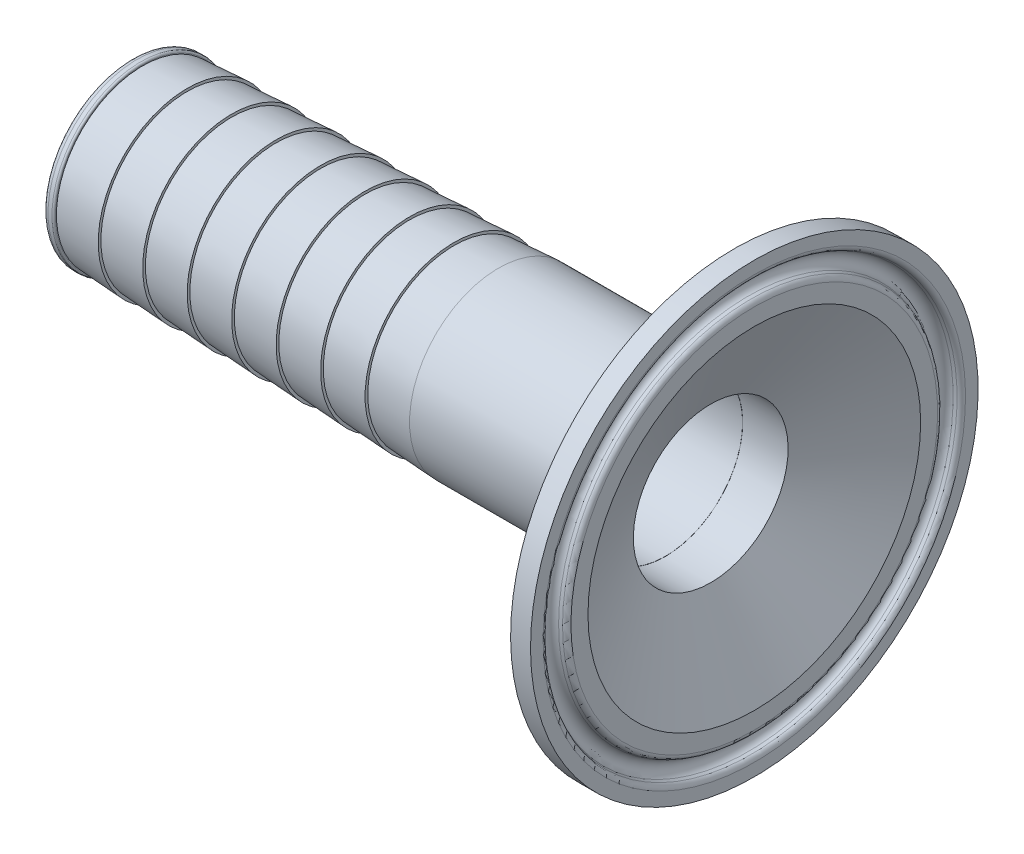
ISO-10303-21;
HEADER;
FILE_DESCRIPTION(('STEP AP214'),'2;1');
FILE_NAME('part.step','',(''),(''),'','','');
FILE_SCHEMA(('AUTOMOTIVE_DESIGN { 1 0 10303 214 1 1 1 1 }'));
ENDSEC;
DATA;
#1=APPLICATION_CONTEXT('core data for automotive mechanical design processes');
#2=APPLICATION_PROTOCOL_DEFINITION('international standard','automotive_design',2000,#1);
#3=PRODUCT_CONTEXT('',#1,'mechanical');
#4=PRODUCT('Part','Part','',(#3));
#5=PRODUCT_RELATED_PRODUCT_CATEGORY('part','',(#4));
#6=PRODUCT_DEFINITION_FORMATION('','',#4);
#7=PRODUCT_DEFINITION_CONTEXT('part definition',#1,'design');
#8=PRODUCT_DEFINITION('design','',#6,#7);
#9=PRODUCT_DEFINITION_SHAPE('','',#8);
#10=(LENGTH_UNIT() NAMED_UNIT(*) SI_UNIT(.MILLI.,.METRE.));
#11=(NAMED_UNIT(*) PLANE_ANGLE_UNIT() SI_UNIT($,.RADIAN.));
#12=(NAMED_UNIT(*) SI_UNIT($,.STERADIAN.) SOLID_ANGLE_UNIT());
#13=UNCERTAINTY_MEASURE_WITH_UNIT(LENGTH_MEASURE(1.E-05),#10,'distance_accuracy_value','');
#14=(GEOMETRIC_REPRESENTATION_CONTEXT(3) GLOBAL_UNCERTAINTY_ASSIGNED_CONTEXT((#13)) GLOBAL_UNIT_ASSIGNED_CONTEXT((#10,
#11,#12)) REPRESENTATION_CONTEXT('',''));
#15=CARTESIAN_POINT('',(0.,0.,0.));
#16=DIRECTION('',(0.,0.,1.));
#17=DIRECTION('',(1.,0.,0.));
#18=AXIS2_PLACEMENT_3D('',#15,#16,#17);
#19=CARTESIAN_POINT('',(59.9390900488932,52.6942676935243,41.7146443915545));
#20=DIRECTION('',(1.,0.,0.));
#21=DIRECTION('',(0.,0.,-1.));
#22=AXIS2_PLACEMENT_3D('',#19,#20,#21);
#23=PLANE('',#22);
#24=CARTESIAN_POINT('',(59.9390900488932,39.9942676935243,41.7146443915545));
#25=DIRECTION('',(1.,0.,0.));
#26=DIRECTION('',(0.,0.,-1.));
#27=AXIS2_PLACEMENT_3D('',#24,#25,#26);
#28=CIRCLE('',#27,11.0297020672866);
#29=CARTESIAN_POINT('',(59.9390900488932,39.9942676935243,30.6849423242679));
#30=VERTEX_POINT('',#29);
#31=EDGE_CURVE('P0_E86',#30,#30,#28,.T.);
#32=ORIENTED_EDGE('',*,*,#31,.F.);
#33=EDGE_LOOP('',(#32));
#34=FACE_BOUND('',#33,.T.);
#35=CARTESIAN_POINT('',(59.9390900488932,39.9942676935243,41.7146443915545));
#36=DIRECTION('',(1.,0.,0.));
#37=DIRECTION('',(0.,0.,-1.));
#38=AXIS2_PLACEMENT_3D('',#35,#36,#37);
#39=CIRCLE('',#38,12.7);
#40=CARTESIAN_POINT('',(59.9390900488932,39.9942676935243,29.0146443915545));
#41=VERTEX_POINT('',#40);
#42=EDGE_CURVE('P0_E10',#41,#41,#39,.T.);
#43=ORIENTED_EDGE('',*,*,#42,.T.);
#44=EDGE_LOOP('',(#43));
#45=FACE_BOUND('',#44,.T.);
#46=ADVANCED_FACE('P0_F15',(#34,#45),#23,.T.);
#47=CARTESIAN_POINT('',(59.9390900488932,39.9942676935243,41.7146443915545));
#48=DIRECTION('',(1.,0.,0.));
#49=DIRECTION('',(0.,0.,-1.));
#50=AXIS2_PLACEMENT_3D('',#47,#48,#49);
#51=CYLINDRICAL_SURFACE('',#50,12.7);
#52=CARTESIAN_POINT('',(36.1138900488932,39.9942676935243,41.7146443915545));
#53=DIRECTION('',(1.,0.,0.));
#54=DIRECTION('',(0.,0.,-1.));
#55=AXIS2_PLACEMENT_3D('',#52,#53,#54);
#56=CIRCLE('',#55,12.7);
#57=CARTESIAN_POINT('',(36.1138900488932,39.9942676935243,29.0146443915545));
#58=VERTEX_POINT('',#57);
#59=EDGE_CURVE('P0_E21',#58,#58,#56,.T.);
#60=ORIENTED_EDGE('',*,*,#59,.T.);
#61=EDGE_LOOP('',(#60));
#62=FACE_BOUND('',#61,.T.);
#63=ORIENTED_EDGE('',*,*,#42,.F.);
#64=EDGE_LOOP('',(#63));
#65=FACE_BOUND('',#64,.T.);
#66=ADVANCED_FACE('P0_F102',(#62,#65),#51,.T.);
#67=CARTESIAN_POINT('',(36.1138900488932,39.9942676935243,41.7146443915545));
#68=DIRECTION('',(1.,0.,0.));
#69=DIRECTION('',(0.,0.,-1.));
#70=AXIS2_PLACEMENT_3D('',#67,#68,#69);
#71=CONICAL_SURFACE('',#70,12.7,0.0599281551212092);
#72=CARTESIAN_POINT('',(29.7638900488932,39.9942676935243,41.7146443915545));
#73=DIRECTION('',(1.,0.,0.));
#74=DIRECTION('',(0.,0.,-1.));
#75=AXIS2_PLACEMENT_3D('',#72,#73,#74);
#76=CIRCLE('',#75,12.319);
#77=CARTESIAN_POINT('',(29.7638900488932,39.9942676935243,29.3956443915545));
#78=VERTEX_POINT('',#77);
#79=EDGE_CURVE('P0_E25',#78,#78,#76,.T.);
#80=ORIENTED_EDGE('',*,*,#79,.T.);
#81=EDGE_LOOP('',(#80));
#82=FACE_BOUND('',#81,.T.);
#83=ORIENTED_EDGE('',*,*,#59,.F.);
#84=EDGE_LOOP('',(#83));
#85=FACE_BOUND('',#84,.T.);
#86=ADVANCED_FACE('P0_F107',(#82,#85),#71,.T.);
#87=CARTESIAN_POINT('',(29.7638900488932,52.6942676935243,41.7146443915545));
#88=DIRECTION('',(1.,0.,0.));
#89=DIRECTION('',(0.,0.,-1.));
#90=AXIS2_PLACEMENT_3D('',#87,#88,#89);
#91=PLANE('',#90);
#92=CARTESIAN_POINT('',(29.7638900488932,39.9942676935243,41.7146443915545));
#93=DIRECTION('',(1.,0.,0.));
#94=DIRECTION('',(0.,0.,-1.));
#95=AXIS2_PLACEMENT_3D('',#92,#93,#94);
#96=CIRCLE('',#95,12.7);
#97=CARTESIAN_POINT('',(29.7638900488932,39.9942676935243,29.0146443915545));
#98=VERTEX_POINT('',#97);
#99=EDGE_CURVE('P0_E29',#98,#98,#96,.T.);
#100=ORIENTED_EDGE('',*,*,#99,.T.);
#101=EDGE_LOOP('',(#100));
#102=FACE_BOUND('',#101,.T.);
#103=ORIENTED_EDGE('',*,*,#79,.F.);
#104=EDGE_LOOP('',(#103));
#105=FACE_BOUND('',#104,.T.);
#106=ADVANCED_FACE('P0_F111',(#102,#105),#91,.T.);
#107=CARTESIAN_POINT('',(29.7638900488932,39.9942676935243,41.7146443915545));
#108=DIRECTION('',(1.,0.,0.));
#109=DIRECTION('',(0.,0.,-1.));
#110=AXIS2_PLACEMENT_3D('',#107,#108,#109);
#111=CONICAL_SURFACE('',#110,12.7,0.0599281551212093);
#112=CARTESIAN_POINT('',(23.4138900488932,39.9942676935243,41.7146443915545));
#113=DIRECTION('',(1.,0.,0.));
#114=DIRECTION('',(0.,0.,-1.));
#115=AXIS2_PLACEMENT_3D('',#112,#113,#114);
#116=CIRCLE('',#115,12.319);
#117=CARTESIAN_POINT('',(23.4138900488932,39.9942676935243,29.3956443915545));
#118=VERTEX_POINT('',#117);
#119=EDGE_CURVE('P0_E34',#118,#118,#116,.T.);
#120=ORIENTED_EDGE('',*,*,#119,.T.);
#121=EDGE_LOOP('',(#120));
#122=FACE_BOUND('',#121,.T.);
#123=ORIENTED_EDGE('',*,*,#99,.F.);
#124=EDGE_LOOP('',(#123));
#125=FACE_BOUND('',#124,.T.);
#126=ADVANCED_FACE('P0_F118',(#122,#125),#111,.T.);
#127=CARTESIAN_POINT('',(23.4138900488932,52.6942676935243,41.7146443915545));
#128=DIRECTION('',(1.,0.,0.));
#129=DIRECTION('',(0.,0.,-1.));
#130=AXIS2_PLACEMENT_3D('',#127,#128,#129);
#131=PLANE('',#130);
#132=CARTESIAN_POINT('',(23.4138900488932,39.9942676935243,41.7146443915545));
#133=DIRECTION('',(1.,0.,0.));
#134=DIRECTION('',(0.,0.,-1.));
#135=AXIS2_PLACEMENT_3D('',#132,#133,#134);
#136=CIRCLE('',#135,12.7);
#137=CARTESIAN_POINT('',(23.4138900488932,39.9942676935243,29.0146443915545));
#138=VERTEX_POINT('',#137);
#139=EDGE_CURVE('P0_E37',#138,#138,#136,.T.);
#140=ORIENTED_EDGE('',*,*,#139,.T.);
#141=EDGE_LOOP('',(#140));
#142=FACE_BOUND('',#141,.T.);
#143=ORIENTED_EDGE('',*,*,#119,.F.);
#144=EDGE_LOOP('',(#143));
#145=FACE_BOUND('',#144,.T.);
#146=ADVANCED_FACE('P0_F122',(#142,#145),#131,.T.);
#147=CARTESIAN_POINT('',(23.4138900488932,39.9942676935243,41.7146443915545));
#148=DIRECTION('',(1.,0.,0.));
#149=DIRECTION('',(0.,0.,-1.));
#150=AXIS2_PLACEMENT_3D('',#147,#148,#149);
#151=CONICAL_SURFACE('',#150,12.7,0.0599281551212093);
#152=CARTESIAN_POINT('',(17.0638900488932,39.9942676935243,41.7146443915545));
#153=DIRECTION('',(1.,0.,0.));
#154=DIRECTION('',(0.,0.,-1.));
#155=AXIS2_PLACEMENT_3D('',#152,#153,#154);
#156=CIRCLE('',#155,12.319);
#157=CARTESIAN_POINT('',(17.0638900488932,39.9942676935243,29.3956443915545));
#158=VERTEX_POINT('',#157);
#159=EDGE_CURVE('P0_E40',#158,#158,#156,.T.);
#160=ORIENTED_EDGE('',*,*,#159,.T.);
#161=EDGE_LOOP('',(#160));
#162=FACE_BOUND('',#161,.T.);
#163=ORIENTED_EDGE('',*,*,#139,.F.);
#164=EDGE_LOOP('',(#163));
#165=FACE_BOUND('',#164,.T.);
#166=ADVANCED_FACE('P0_F126',(#162,#165),#151,.T.);
#167=CARTESIAN_POINT('',(17.0638900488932,52.6942676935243,41.7146443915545));
#168=DIRECTION('',(1.,0.,0.));
#169=DIRECTION('',(0.,0.,-1.));
#170=AXIS2_PLACEMENT_3D('',#167,#168,#169);
#171=PLANE('',#170);
#172=CARTESIAN_POINT('',(17.0638900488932,39.9942676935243,41.7146443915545));
#173=DIRECTION('',(1.,0.,0.));
#174=DIRECTION('',(0.,0.,-1.));
#175=AXIS2_PLACEMENT_3D('',#172,#173,#174);
#176=CIRCLE('',#175,12.7);
#177=CARTESIAN_POINT('',(17.0638900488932,39.9942676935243,29.0146443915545));
#178=VERTEX_POINT('',#177);
#179=EDGE_CURVE('P0_E43',#178,#178,#176,.T.);
#180=ORIENTED_EDGE('',*,*,#179,.T.);
#181=EDGE_LOOP('',(#180));
#182=FACE_BOUND('',#181,.T.);
#183=ORIENTED_EDGE('',*,*,#159,.F.);
#184=EDGE_LOOP('',(#183));
#185=FACE_BOUND('',#184,.T.);
#186=ADVANCED_FACE('P0_F130',(#182,#185),#171,.T.);
#187=CARTESIAN_POINT('',(17.0638900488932,39.9942676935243,41.7146443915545));
#188=DIRECTION('',(1.,0.,0.));
#189=DIRECTION('',(0.,0.,-1.));
#190=AXIS2_PLACEMENT_3D('',#187,#188,#189);
#191=CONICAL_SURFACE('',#190,12.7,0.0599281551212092);
#192=CARTESIAN_POINT('',(10.7138900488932,39.9942676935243,41.7146443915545));
#193=DIRECTION('',(1.,0.,0.));
#194=DIRECTION('',(0.,0.,-1.));
#195=AXIS2_PLACEMENT_3D('',#192,#193,#194);
#196=CIRCLE('',#195,12.319);
#197=CARTESIAN_POINT('',(10.7138900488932,39.9942676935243,29.3956443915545));
#198=VERTEX_POINT('',#197);
#199=EDGE_CURVE('P0_E46',#198,#198,#196,.T.);
#200=ORIENTED_EDGE('',*,*,#199,.T.);
#201=EDGE_LOOP('',(#200));
#202=FACE_BOUND('',#201,.T.);
#203=ORIENTED_EDGE('',*,*,#179,.F.);
#204=EDGE_LOOP('',(#203));
#205=FACE_BOUND('',#204,.T.);
#206=ADVANCED_FACE('P0_F134',(#202,#205),#191,.T.);
#207=CARTESIAN_POINT('',(10.7138900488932,52.6942676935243,41.7146443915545));
#208=DIRECTION('',(1.,0.,0.));
#209=DIRECTION('',(0.,0.,-1.));
#210=AXIS2_PLACEMENT_3D('',#207,#208,#209);
#211=PLANE('',#210);
#212=CARTESIAN_POINT('',(10.7138900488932,39.9942676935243,41.7146443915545));
#213=DIRECTION('',(1.,0.,0.));
#214=DIRECTION('',(0.,0.,-1.));
#215=AXIS2_PLACEMENT_3D('',#212,#213,#214);
#216=CIRCLE('',#215,12.7);
#217=CARTESIAN_POINT('',(10.7138900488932,39.9942676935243,29.0146443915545));
#218=VERTEX_POINT('',#217);
#219=EDGE_CURVE('P0_E49',#218,#218,#216,.T.);
#220=ORIENTED_EDGE('',*,*,#219,.T.);
#221=EDGE_LOOP('',(#220));
#222=FACE_BOUND('',#221,.T.);
#223=ORIENTED_EDGE('',*,*,#199,.F.);
#224=EDGE_LOOP('',(#223));
#225=FACE_BOUND('',#224,.T.);
#226=ADVANCED_FACE('P0_F138',(#222,#225),#211,.T.);
#227=CARTESIAN_POINT('',(10.7138900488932,39.9942676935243,41.7146443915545));
#228=DIRECTION('',(1.,0.,0.));
#229=DIRECTION('',(0.,0.,-1.));
#230=AXIS2_PLACEMENT_3D('',#227,#228,#229);
#231=CONICAL_SURFACE('',#230,12.7,0.0599281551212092);
#232=CARTESIAN_POINT('',(4.36389004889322,39.9942676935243,41.7146443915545));
#233=DIRECTION('',(1.,0.,0.));
#234=DIRECTION('',(0.,0.,-1.));
#235=AXIS2_PLACEMENT_3D('',#232,#233,#234);
#236=CIRCLE('',#235,12.319);
#237=CARTESIAN_POINT('',(4.36389004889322,39.9942676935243,29.3956443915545));
#238=VERTEX_POINT('',#237);
#239=EDGE_CURVE('P0_E52',#238,#238,#236,.T.);
#240=ORIENTED_EDGE('',*,*,#239,.T.);
#241=EDGE_LOOP('',(#240));
#242=FACE_BOUND('',#241,.T.);
#243=ORIENTED_EDGE('',*,*,#219,.F.);
#244=EDGE_LOOP('',(#243));
#245=FACE_BOUND('',#244,.T.);
#246=ADVANCED_FACE('P0_F142',(#242,#245),#231,.T.);
#247=CARTESIAN_POINT('',(4.36389004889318,52.6942676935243,41.7146443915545));
#248=DIRECTION('',(1.,0.,0.));
#249=DIRECTION('',(0.,0.,-1.));
#250=AXIS2_PLACEMENT_3D('',#247,#248,#249);
#251=PLANE('',#250);
#252=CARTESIAN_POINT('',(4.36389004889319,39.9942676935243,41.7146443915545));
#253=DIRECTION('',(1.,0.,0.));
#254=DIRECTION('',(0.,0.,-1.));
#255=AXIS2_PLACEMENT_3D('',#252,#253,#254);
#256=CIRCLE('',#255,12.7);
#257=CARTESIAN_POINT('',(4.36389004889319,39.9942676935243,29.0146443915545));
#258=VERTEX_POINT('',#257);
#259=EDGE_CURVE('P0_E55',#258,#258,#256,.T.);
#260=ORIENTED_EDGE('',*,*,#259,.T.);
#261=EDGE_LOOP('',(#260));
#262=FACE_BOUND('',#261,.T.);
#263=ORIENTED_EDGE('',*,*,#239,.F.);
#264=EDGE_LOOP('',(#263));
#265=FACE_BOUND('',#264,.T.);
#266=ADVANCED_FACE('P0_F146',(#262,#265),#251,.T.);
#267=CARTESIAN_POINT('',(4.36389004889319,39.9942676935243,41.7146443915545));
#268=DIRECTION('',(1.,0.,0.));
#269=DIRECTION('',(0.,0.,-1.));
#270=AXIS2_PLACEMENT_3D('',#267,#268,#269);
#271=CONICAL_SURFACE('',#270,12.7,0.0599281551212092);
#272=CARTESIAN_POINT('',(-1.9861099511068,39.9942676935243,41.7146443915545));
#273=DIRECTION('',(1.,0.,0.));
#274=DIRECTION('',(0.,0.,-1.));
#275=AXIS2_PLACEMENT_3D('',#272,#273,#274);
#276=CIRCLE('',#275,12.319);
#277=CARTESIAN_POINT('',(-1.9861099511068,39.9942676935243,29.3956443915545));
#278=VERTEX_POINT('',#277);
#279=EDGE_CURVE('P0_E58',#278,#278,#276,.T.);
#280=ORIENTED_EDGE('',*,*,#279,.T.);
#281=EDGE_LOOP('',(#280));
#282=FACE_BOUND('',#281,.T.);
#283=ORIENTED_EDGE('',*,*,#259,.F.);
#284=EDGE_LOOP('',(#283));
#285=FACE_BOUND('',#284,.T.);
#286=ADVANCED_FACE('P0_F150',(#282,#285),#271,.T.);
#287=CARTESIAN_POINT('',(-1.98610995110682,52.6942676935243,41.7146443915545));
#288=DIRECTION('',(1.,0.,0.));
#289=DIRECTION('',(0.,0.,-1.));
#290=AXIS2_PLACEMENT_3D('',#287,#288,#289);
#291=PLANE('',#290);
#292=CARTESIAN_POINT('',(-1.9861099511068,39.9942676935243,41.7146443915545));
#293=DIRECTION('',(1.,0.,0.));
#294=DIRECTION('',(0.,0.,-1.));
#295=AXIS2_PLACEMENT_3D('',#292,#293,#294);
#296=CIRCLE('',#295,12.7);
#297=CARTESIAN_POINT('',(-1.9861099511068,39.9942676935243,29.0146443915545));
#298=VERTEX_POINT('',#297);
#299=EDGE_CURVE('P0_E61',#298,#298,#296,.T.);
#300=ORIENTED_EDGE('',*,*,#299,.T.);
#301=EDGE_LOOP('',(#300));
#302=FACE_BOUND('',#301,.T.);
#303=ORIENTED_EDGE('',*,*,#279,.F.);
#304=EDGE_LOOP('',(#303));
#305=FACE_BOUND('',#304,.T.);
#306=ADVANCED_FACE('P0_F154',(#302,#305),#291,.T.);
#307=CARTESIAN_POINT('',(-1.9861099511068,39.9942676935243,41.7146443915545));
#308=DIRECTION('',(1.,0.,0.));
#309=DIRECTION('',(0.,0.,-1.));
#310=AXIS2_PLACEMENT_3D('',#307,#308,#309);
#311=CONICAL_SURFACE('',#310,12.7,0.0599281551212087);
#312=CARTESIAN_POINT('',(-8.33610995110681,39.9942676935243,41.7146443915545));
#313=DIRECTION('',(1.,0.,0.));
#314=DIRECTION('',(0.,0.,-1.));
#315=AXIS2_PLACEMENT_3D('',#312,#313,#314);
#316=CIRCLE('',#315,12.319);
#317=CARTESIAN_POINT('',(-8.3361099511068,39.9942676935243,29.3956443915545));
#318=VERTEX_POINT('',#317);
#319=EDGE_CURVE('P0_E64',#318,#318,#316,.T.);
#320=ORIENTED_EDGE('',*,*,#319,.T.);
#321=EDGE_LOOP('',(#320));
#322=FACE_BOUND('',#321,.T.);
#323=ORIENTED_EDGE('',*,*,#299,.F.);
#324=EDGE_LOOP('',(#323));
#325=FACE_BOUND('',#324,.T.);
#326=ADVANCED_FACE('P0_F158',(#322,#325),#311,.T.);
#327=CARTESIAN_POINT('',(-8.33610995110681,52.6942676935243,41.7146443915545));
#328=DIRECTION('',(1.,0.,0.));
#329=DIRECTION('',(0.,0.,-1.));
#330=AXIS2_PLACEMENT_3D('',#327,#328,#329);
#331=PLANE('',#330);
#332=CARTESIAN_POINT('',(-8.33610995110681,39.9942676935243,41.7146443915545));
#333=DIRECTION('',(1.,0.,0.));
#334=DIRECTION('',(0.,0.,-1.));
#335=AXIS2_PLACEMENT_3D('',#332,#333,#334);
#336=CIRCLE('',#335,12.7);
#337=CARTESIAN_POINT('',(-8.3361099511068,39.9942676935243,29.0146443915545));
#338=VERTEX_POINT('',#337);
#339=EDGE_CURVE('P0_E67',#338,#338,#336,.T.);
#340=ORIENTED_EDGE('',*,*,#339,.T.);
#341=EDGE_LOOP('',(#340));
#342=FACE_BOUND('',#341,.T.);
#343=ORIENTED_EDGE('',*,*,#319,.F.);
#344=EDGE_LOOP('',(#343));
#345=FACE_BOUND('',#344,.T.);
#346=ADVANCED_FACE('P0_F162',(#342,#345),#331,.T.);
#347=CARTESIAN_POINT('',(-8.33610995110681,39.9942676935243,41.7146443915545));
#348=DIRECTION('',(1.,0.,0.));
#349=DIRECTION('',(0.,0.,-1.));
#350=AXIS2_PLACEMENT_3D('',#347,#348,#349);
#351=CONICAL_SURFACE('',#350,12.7,0.0599281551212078);
#352=CARTESIAN_POINT('',(-14.6861099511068,39.9942676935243,41.7146443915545));
#353=DIRECTION('',(1.,0.,0.));
#354=DIRECTION('',(0.,0.,-1.));
#355=AXIS2_PLACEMENT_3D('',#352,#353,#354);
#356=CIRCLE('',#355,12.319);
#357=CARTESIAN_POINT('',(-14.6861099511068,39.9942676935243,29.3956443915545));
#358=VERTEX_POINT('',#357);
#359=EDGE_CURVE('P0_E70',#358,#358,#356,.T.);
#360=ORIENTED_EDGE('',*,*,#359,.T.);
#361=EDGE_LOOP('',(#360));
#362=FACE_BOUND('',#361,.T.);
#363=ORIENTED_EDGE('',*,*,#339,.F.);
#364=EDGE_LOOP('',(#363));
#365=FACE_BOUND('',#364,.T.);
#366=ADVANCED_FACE('P0_F166',(#362,#365),#351,.T.);
#367=CARTESIAN_POINT('',(-14.6861099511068,52.4402676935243,41.7146443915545));
#368=DIRECTION('',(1.,0.,0.));
#369=DIRECTION('',(0.,0.,-1.));
#370=AXIS2_PLACEMENT_3D('',#367,#368,#369);
#371=PLANE('',#370);
#372=CARTESIAN_POINT('',(-14.6861099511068,39.9942676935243,41.7146443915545));
#373=DIRECTION('',(1.,0.,0.));
#374=DIRECTION('',(0.,0.,-1.));
#375=AXIS2_PLACEMENT_3D('',#372,#373,#374);
#376=CIRCLE('',#375,12.446);
#377=CARTESIAN_POINT('',(-14.6861099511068,39.9942676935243,29.2686443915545));
#378=VERTEX_POINT('',#377);
#379=EDGE_CURVE('P0_E73',#378,#378,#376,.T.);
#380=ORIENTED_EDGE('',*,*,#379,.T.);
#381=EDGE_LOOP('',(#380));
#382=FACE_BOUND('',#381,.T.);
#383=ORIENTED_EDGE('',*,*,#359,.F.);
#384=EDGE_LOOP('',(#383));
#385=FACE_BOUND('',#384,.T.);
#386=ADVANCED_FACE('P0_F170',(#382,#385),#371,.T.);
#387=CARTESIAN_POINT('',(-14.9401099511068,39.9942676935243,41.7146443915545));
#388=DIRECTION('',(1.,0.,0.));
#389=DIRECTION('',(0.,0.,-1.));
#390=AXIS2_PLACEMENT_3D('',#387,#388,#389);
#391=TOROIDAL_SURFACE('',#390,12.446,0.254000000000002);
#392=CARTESIAN_POINT('',(-14.9401099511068,39.9942676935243,41.7146443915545));
#393=DIRECTION('',(1.,0.,0.));
#394=DIRECTION('',(0.,0.,-1.));
#395=AXIS2_PLACEMENT_3D('',#392,#393,#394);
#396=CIRCLE('',#395,12.7);
#397=CARTESIAN_POINT('',(-14.9401099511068,39.9942676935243,29.0146443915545));
#398=VERTEX_POINT('',#397);
#399=EDGE_CURVE('P0_E76',#398,#398,#396,.T.);
#400=ORIENTED_EDGE('',*,*,#399,.T.);
#401=EDGE_LOOP('',(#400));
#402=FACE_BOUND('',#401,.T.);
#403=ORIENTED_EDGE('',*,*,#379,.F.);
#404=EDGE_LOOP('',(#403));
#405=FACE_BOUND('',#404,.T.);
#406=ADVANCED_FACE('P0_F174',(#402,#405),#391,.T.);
#407=CARTESIAN_POINT('',(59.9390900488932,39.9942676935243,41.7146443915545));
#408=DIRECTION('',(1.,0.,0.));
#409=DIRECTION('',(0.,0.,-1.));
#410=AXIS2_PLACEMENT_3D('',#407,#408,#409);
#411=CYLINDRICAL_SURFACE('',#410,12.7);
#412=CARTESIAN_POINT('',(-15.4989099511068,39.9942676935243,41.7146443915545));
#413=DIRECTION('',(1.,0.,0.));
#414=DIRECTION('',(0.,0.,-1.));
#415=AXIS2_PLACEMENT_3D('',#412,#413,#414);
#416=CIRCLE('',#415,12.7);
#417=CARTESIAN_POINT('',(-15.4989099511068,39.9942676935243,29.0146443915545));
#418=VERTEX_POINT('',#417);
#419=EDGE_CURVE('P0_E79',#418,#418,#416,.T.);
#420=ORIENTED_EDGE('',*,*,#419,.T.);
#421=EDGE_LOOP('',(#420));
#422=FACE_BOUND('',#421,.T.);
#423=ORIENTED_EDGE('',*,*,#399,.F.);
#424=EDGE_LOOP('',(#423));
#425=FACE_BOUND('',#424,.T.);
#426=ADVANCED_FACE('P0_F178',(#422,#425),#411,.T.);
#427=CARTESIAN_POINT('',(-15.4989099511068,39.9942676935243,41.7146443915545));
#428=DIRECTION('',(1.,0.,0.));
#429=DIRECTION('',(0.,0.,-1.));
#430=AXIS2_PLACEMENT_3D('',#427,#428,#429);
#431=TOROIDAL_SURFACE('',#430,11.938,0.762);
#432=CARTESIAN_POINT('',(-16.2609099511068,39.9942676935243,41.7146443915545));
#433=DIRECTION('',(1.,0.,0.));
#434=DIRECTION('',(0.,0.,-1.));
#435=AXIS2_PLACEMENT_3D('',#432,#433,#434);
#436=CIRCLE('',#435,11.938);
#437=CARTESIAN_POINT('',(-16.2609099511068,39.9942676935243,29.7766443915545));
#438=VERTEX_POINT('',#437);
#439=EDGE_CURVE('P0_E82',#438,#438,#436,.T.);
#440=ORIENTED_EDGE('',*,*,#439,.T.);
#441=EDGE_LOOP('',(#440));
#442=FACE_BOUND('',#441,.T.);
#443=ORIENTED_EDGE('',*,*,#419,.F.);
#444=EDGE_LOOP('',(#443));
#445=FACE_BOUND('',#444,.T.);
#446=ADVANCED_FACE('P0_F182',(#442,#445),#431,.T.);
#447=CARTESIAN_POINT('',(-16.2609099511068,39.9942676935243,41.7146443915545));
#448=DIRECTION('',(-1.,0.,0.));
#449=DIRECTION('',(0.,0.,1.));
#450=AXIS2_PLACEMENT_3D('',#447,#448,#449);
#451=PLANE('',#450);
#452=CARTESIAN_POINT('',(-16.2609099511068,39.9942676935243,41.7146443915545));
#453=DIRECTION('',(1.,0.,0.));
#454=DIRECTION('',(0.,0.,-1.));
#455=AXIS2_PLACEMENT_3D('',#452,#453,#454);
#456=CIRCLE('',#455,11.0297020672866);
#457=CARTESIAN_POINT('',(-16.2609099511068,39.9942676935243,30.6849423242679));
#458=VERTEX_POINT('',#457);
#459=EDGE_CURVE('P0_E85',#458,#458,#456,.T.);
#460=ORIENTED_EDGE('',*,*,#459,.T.);
#461=EDGE_LOOP('',(#460));
#462=FACE_BOUND('',#461,.T.);
#463=ORIENTED_EDGE('',*,*,#439,.F.);
#464=EDGE_LOOP('',(#463));
#465=FACE_BOUND('',#464,.T.);
#466=ADVANCED_FACE('P0_F92',(#462,#465),#451,.T.);
#467=CARTESIAN_POINT('',(-16.2609099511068,39.9942676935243,41.7146443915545));
#468=DIRECTION('',(1.,0.,0.));
#469=DIRECTION('',(0.,0.,-1.));
#470=AXIS2_PLACEMENT_3D('',#467,#468,#469);
#471=CYLINDRICAL_SURFACE('',#470,11.0297020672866);
#472=CARTESIAN_POINT('',(-16.2609099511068,39.9942676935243,30.6849423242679));
#473=CARTESIAN_POINT('',(-15.4671599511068,39.9942676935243,30.6849423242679));
#474=CARTESIAN_POINT('',(-14.6734099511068,39.9942676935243,30.6849423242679));
#475=CARTESIAN_POINT('',(-13.0859099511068,39.9942676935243,30.6849423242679));
#476=CARTESIAN_POINT('',(-12.2921599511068,39.9942676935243,30.6849423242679));
#477=CARTESIAN_POINT('',(-10.7046599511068,39.9942676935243,30.6849423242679));
#478=CARTESIAN_POINT('',(-9.91090995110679,39.9942676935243,30.6849423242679));
#479=CARTESIAN_POINT('',(-8.32340995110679,39.9942676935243,30.6849423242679));
#480=CARTESIAN_POINT('',(-7.52965995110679,39.9942676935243,30.6849423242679));
#481=CARTESIAN_POINT('',(-5.94215995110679,39.9942676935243,30.6849423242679));
#482=CARTESIAN_POINT('',(-5.14840995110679,39.9942676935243,30.6849423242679));
#483=CARTESIAN_POINT('',(-3.56090995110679,39.9942676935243,30.6849423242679));
#484=CARTESIAN_POINT('',(-2.76715995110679,39.9942676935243,30.6849423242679));
#485=CARTESIAN_POINT('',(-1.17965995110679,39.9942676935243,30.6849423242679));
#486=CARTESIAN_POINT('',(-0.385909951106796,39.9942676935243,30.6849423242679));
#487=CARTESIAN_POINT('',(1.2015900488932,39.9942676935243,30.6849423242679));
#488=CARTESIAN_POINT('',(1.9953400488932,39.9942676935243,30.6849423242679));
#489=CARTESIAN_POINT('',(3.5828400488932,39.9942676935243,30.6849423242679));
#490=CARTESIAN_POINT('',(4.3765900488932,39.9942676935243,30.6849423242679));
#491=CARTESIAN_POINT('',(5.9640900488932,39.9942676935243,30.6849423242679));
#492=CARTESIAN_POINT('',(6.7578400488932,39.9942676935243,30.6849423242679));
#493=CARTESIAN_POINT('',(8.3453400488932,39.9942676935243,30.6849423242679));
#494=CARTESIAN_POINT('',(9.1390900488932,39.9942676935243,30.6849423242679));
#495=CARTESIAN_POINT('',(10.7265900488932,39.9942676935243,30.6849423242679));
#496=CARTESIAN_POINT('',(11.5203400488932,39.9942676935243,30.6849423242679));
#497=CARTESIAN_POINT('',(13.1078400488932,39.9942676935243,30.6849423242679));
#498=CARTESIAN_POINT('',(13.9015900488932,39.9942676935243,30.6849423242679));
#499=CARTESIAN_POINT('',(15.4890900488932,39.9942676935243,30.6849423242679));
#500=CARTESIAN_POINT('',(16.2828400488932,39.9942676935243,30.6849423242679));
#501=CARTESIAN_POINT('',(17.8703400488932,39.9942676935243,30.6849423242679));
#502=CARTESIAN_POINT('',(18.6640900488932,39.9942676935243,30.6849423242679));
#503=CARTESIAN_POINT('',(20.2515900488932,39.9942676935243,30.6849423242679));
#504=CARTESIAN_POINT('',(21.0453400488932,39.9942676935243,30.6849423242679));
#505=CARTESIAN_POINT('',(22.6328400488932,39.9942676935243,30.6849423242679));
#506=CARTESIAN_POINT('',(23.4265900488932,39.9942676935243,30.6849423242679));
#507=CARTESIAN_POINT('',(25.0140900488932,39.9942676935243,30.6849423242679));
#508=CARTESIAN_POINT('',(25.8078400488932,39.9942676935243,30.6849423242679));
#509=CARTESIAN_POINT('',(27.3953400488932,39.9942676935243,30.6849423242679));
#510=CARTESIAN_POINT('',(28.1890900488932,39.9942676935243,30.6849423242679));
#511=CARTESIAN_POINT('',(29.7765900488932,39.9942676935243,30.6849423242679));
#512=CARTESIAN_POINT('',(30.5703400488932,39.9942676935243,30.6849423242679));
#513=CARTESIAN_POINT('',(32.1578400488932,39.9942676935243,30.6849423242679));
#514=CARTESIAN_POINT('',(32.9515900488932,39.9942676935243,30.6849423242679));
#515=CARTESIAN_POINT('',(34.5390900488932,39.9942676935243,30.6849423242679));
#516=CARTESIAN_POINT('',(35.3328400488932,39.9942676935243,30.6849423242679));
#517=CARTESIAN_POINT('',(36.9203400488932,39.9942676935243,30.6849423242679));
#518=CARTESIAN_POINT('',(37.7140900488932,39.9942676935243,30.6849423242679));
#519=CARTESIAN_POINT('',(39.3015900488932,39.9942676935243,30.6849423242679));
#520=CARTESIAN_POINT('',(40.0953400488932,39.9942676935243,30.6849423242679));
#521=CARTESIAN_POINT('',(41.6828400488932,39.9942676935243,30.6849423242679));
#522=CARTESIAN_POINT('',(42.4765900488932,39.9942676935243,30.6849423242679));
#523=CARTESIAN_POINT('',(44.0640900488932,39.9942676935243,30.6849423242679));
#524=CARTESIAN_POINT('',(44.8578400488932,39.9942676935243,30.6849423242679));
#525=CARTESIAN_POINT('',(46.4453400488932,39.9942676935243,30.6849423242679));
#526=CARTESIAN_POINT('',(47.2390900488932,39.9942676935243,30.6849423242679));
#527=CARTESIAN_POINT('',(48.8265900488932,39.9942676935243,30.6849423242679));
#528=CARTESIAN_POINT('',(49.6203400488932,39.9942676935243,30.6849423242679));
#529=CARTESIAN_POINT('',(51.2078400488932,39.9942676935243,30.6849423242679));
#530=CARTESIAN_POINT('',(52.0015900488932,39.9942676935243,30.6849423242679));
#531=CARTESIAN_POINT('',(53.5890900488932,39.9942676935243,30.6849423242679));
#532=CARTESIAN_POINT('',(54.3828400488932,39.9942676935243,30.6849423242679));
#533=CARTESIAN_POINT('',(55.9703400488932,39.9942676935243,30.6849423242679));
#534=CARTESIAN_POINT('',(56.7640900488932,39.9942676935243,30.6849423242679));
#535=CARTESIAN_POINT('',(58.3515900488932,39.9942676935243,30.6849423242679));
#536=CARTESIAN_POINT('',(59.1453400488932,39.9942676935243,30.6849423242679));
#537=CARTESIAN_POINT('',(59.9390900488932,39.9942676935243,30.6849423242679));
#538=B_SPLINE_CURVE_WITH_KNOTS('',3,(#472,#473,#474,#475,#476,#477,#478,#479,#480,#481,#482,
#483,#484,#485,#486,#487,#488,#489,#490,#491,#492,#493,#494,#495,#496,#497,#498,#499,#500,#501,
#502,#503,#504,#505,#506,#507,#508,#509,#510,#511,#512,#513,#514,#515,#516,#517,#518,#519,#520,
#521,#522,#523,#524,#525,#526,#527,#528,#529,#530,#531,#532,#533,#534,#535,#536,#537),
.UNSPECIFIED.,.F.,.F.,(4,2,2,2,2,2,2,2,2,2,2,2,2,2,2,2,2,2,2,2,2,2,2,2,2,2,2,2,2,2,2,2,4),(0.,
2.38125,4.7625,7.14375,9.525,11.90625,14.2875,16.66875,19.05,21.43125,23.8125,26.19375,28.575,
30.95625,33.3375,35.71875,38.1,40.48125,42.8625,45.24375,47.625,50.00625,52.3875,54.76875,57.15,
59.53125,61.9125,64.29375,66.675,69.05625,71.4375,73.81875,76.2),.UNSPECIFIED.);
#539=EDGE_CURVE('P0_BSEAM95',#458,#30,#538,.T.);
#540=ORIENTED_EDGE('',*,*,#459,.F.);
#541=ORIENTED_EDGE('',*,*,#31,.T.);
#542=ORIENTED_EDGE('',*,*,#539,.T.);
#543=ORIENTED_EDGE('',*,*,#539,.F.);
#544=EDGE_LOOP('',(#540,#542,#541,#543));
#545=FACE_BOUND('',#544,.T.);
#546=ADVANCED_FACE('P0_F95',(#545),#471,.F.);
#547=CLOSED_SHELL('',(#46,#66,#86,#106,#126,#146,#166,#186,#206,#226,#246,#266,#286,#306,#326,
#346,#366,#386,#406,#426,#446,#466,#546));
#548=MANIFOLD_SOLID_BREP('P0_B1',#547);
#549=CARTESIAN_POINT('',(59.9390900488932,43.9739608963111,52.0220418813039));
#550=DIRECTION('',(1.,0.,0.));
#551=DIRECTION('',(0.,-0.932880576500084,0.360185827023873));
#552=AXIS2_PLACEMENT_3D('',#549,#550,#551);
#553=PLANE('',#552);
#554=CARTESIAN_POINT('',(59.9390900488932,39.9942676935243,41.7146443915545));
#555=DIRECTION('',(1.,0.,0.));
#556=DIRECTION('',(0.,-0.932880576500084,0.360185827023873));
#557=AXIS2_PLACEMENT_3D('',#554,#555,#556);
#558=CIRCLE('',#557,12.7);
#559=CARTESIAN_POINT('',(59.9390900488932,28.1466843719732,46.2890043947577));
#560=VERTEX_POINT('',#559);
#561=EDGE_CURVE('P1_E9',#560,#560,#558,.T.);
#562=ORIENTED_EDGE('',*,*,#561,.F.);
#563=EDGE_LOOP('',(#562));
#564=FACE_BOUND('',#563,.T.);
#565=CARTESIAN_POINT('',(59.9390900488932,39.9942676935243,41.7146443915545));
#566=DIRECTION('',(1.,0.,0.));
#567=DIRECTION('',(0.,-0.932880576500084,0.360185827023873));
#568=AXIS2_PLACEMENT_3D('',#565,#566,#567);
#569=CIRCLE('',#568,11.049);
#570=CARTESIAN_POINT('',(59.9390900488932,29.6868702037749,45.6943375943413));
#571=VERTEX_POINT('',#570);
#572=EDGE_CURVE('P1_E63',#571,#571,#569,.T.);
#573=ORIENTED_EDGE('',*,*,#572,.T.);
#574=EDGE_LOOP('',(#573));
#575=FACE_BOUND('',#574,.T.);
#576=ADVANCED_FACE('P1_F14',(#564,#575),#553,.F.);
#577=CARTESIAN_POINT('',(72.6390900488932,39.9942676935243,41.7146443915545));
#578=DIRECTION('',(1.,0.,0.));
#579=DIRECTION('',(0.,-0.932880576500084,0.360185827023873));
#580=AXIS2_PLACEMENT_3D('',#577,#578,#579);
#581=CYLINDRICAL_SURFACE('',#580,12.7);
#582=CARTESIAN_POINT('',(63.1140900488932,39.9942676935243,41.7146443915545));
#583=DIRECTION('',(1.,0.,0.));
#584=DIRECTION('',(0.,-0.932880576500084,0.360185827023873));
#585=AXIS2_PLACEMENT_3D('',#582,#583,#584);
#586=CIRCLE('',#585,12.7);
#587=CARTESIAN_POINT('',(63.1140900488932,28.1466843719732,46.2890043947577));
#588=VERTEX_POINT('',#587);
#589=EDGE_CURVE('P1_E20',#588,#588,#586,.T.);
#590=ORIENTED_EDGE('',*,*,#589,.F.);
#591=EDGE_LOOP('',(#590));
#592=FACE_BOUND('',#591,.T.);
#593=ORIENTED_EDGE('',*,*,#561,.T.);
#594=EDGE_LOOP('',(#593));
#595=FACE_BOUND('',#594,.T.);
#596=ADVANCED_FACE('P1_F142',(#592,#595),#581,.T.);
#597=CARTESIAN_POINT('',(63.1140900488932,39.9942676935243,41.7146443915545));
#598=DIRECTION('',(1.,0.,0.));
#599=DIRECTION('',(0.,-0.932880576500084,0.360185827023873));
#600=AXIS2_PLACEMENT_3D('',#597,#598,#599);
#601=TOROIDAL_SURFACE('',#600,15.875,3.175);
#602=CARTESIAN_POINT('',(66.2890900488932,39.9942676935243,41.7146443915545));
#603=DIRECTION('',(1.,0.,0.));
#604=DIRECTION('',(0.,-0.932880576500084,0.360185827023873));
#605=AXIS2_PLACEMENT_3D('',#602,#603,#604);
#606=CIRCLE('',#605,15.875);
#607=CARTESIAN_POINT('',(66.2890900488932,25.1847885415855,47.4325943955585));
#608=VERTEX_POINT('',#607);
#609=EDGE_CURVE('P1_E24',#608,#608,#606,.T.);
#610=ORIENTED_EDGE('',*,*,#609,.F.);
#611=EDGE_LOOP('',(#610));
#612=FACE_BOUND('',#611,.T.);
#613=ORIENTED_EDGE('',*,*,#589,.T.);
#614=EDGE_LOOP('',(#613));
#615=FACE_BOUND('',#614,.T.);
#616=ADVANCED_FACE('P1_F137',(#612,#615),#601,.F.);
#617=CARTESIAN_POINT('',(66.2890900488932,45.7122176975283,56.5241235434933));
#618=DIRECTION('',(1.,0.,0.));
#619=DIRECTION('',(0.,-0.932880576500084,0.360185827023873));
#620=AXIS2_PLACEMENT_3D('',#617,#618,#619);
#621=PLANE('',#620);
#622=CARTESIAN_POINT('',(66.2890900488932,39.9942676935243,41.7146443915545));
#623=DIRECTION('',(1.,0.,0.));
#624=DIRECTION('',(0.,-0.932880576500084,0.360185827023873));
#625=AXIS2_PLACEMENT_3D('',#622,#623,#624);
#626=CIRCLE('',#625,22.3227421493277);
#627=CARTESIAN_POINT('',(66.2890900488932,19.1698151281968,49.7549797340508));
#628=VERTEX_POINT('',#627);
#629=EDGE_CURVE('P1_E28',#628,#628,#626,.T.);
#630=ORIENTED_EDGE('',*,*,#629,.F.);
#631=EDGE_LOOP('',(#630));
#632=FACE_BOUND('',#631,.T.);
#633=ORIENTED_EDGE('',*,*,#609,.T.);
#634=EDGE_LOOP('',(#633));
#635=FACE_BOUND('',#634,.T.);
#636=ADVANCED_FACE('P1_F131',(#632,#635),#621,.F.);
#637=CARTESIAN_POINT('',(66.2890900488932,39.9942676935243,41.7146443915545));
#638=DIRECTION('',(1.,0.,0.));
#639=DIRECTION('',(0.,-0.932880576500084,0.360185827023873));
#640=AXIS2_PLACEMENT_3D('',#637,#638,#639);
#641=CONICAL_SURFACE('',#640,22.3227421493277,1.22173047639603);
#642=CARTESIAN_POINT('',(69.7942900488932,39.9942676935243,41.7146443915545));
#643=DIRECTION('',(1.,0.,0.));
#644=DIRECTION('',(0.,-0.932880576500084,0.360185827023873));
#645=AXIS2_PLACEMENT_3D('',#642,#643,#644);
#646=CIRCLE('',#645,31.9532);
#647=CARTESIAN_POINT('',(69.7942900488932,10.1857480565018,53.2237341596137));
#648=VERTEX_POINT('',#647);
#649=EDGE_CURVE('P1_E33',#648,#648,#646,.T.);
#650=ORIENTED_EDGE('',*,*,#649,.F.);
#651=EDGE_LOOP('',(#650));
#652=FACE_BOUND('',#651,.T.);
#653=ORIENTED_EDGE('',*,*,#629,.T.);
#654=EDGE_LOOP('',(#653));
#655=FACE_BOUND('',#654,.T.);
#656=ADVANCED_FACE('P1_F125',(#652,#655),#641,.T.);
#657=CARTESIAN_POINT('',(72.6390900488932,39.9942676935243,41.7146443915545));
#658=DIRECTION('',(1.,0.,0.));
#659=DIRECTION('',(0.,-0.932880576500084,0.360185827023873));
#660=AXIS2_PLACEMENT_3D('',#657,#658,#659);
#661=CYLINDRICAL_SURFACE('',#660,31.9532);
#662=CARTESIAN_POINT('',(72.6390900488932,39.9942676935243,41.7146443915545));
#663=DIRECTION('',(1.,0.,0.));
#664=DIRECTION('',(0.,-0.932880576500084,0.360185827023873));
#665=AXIS2_PLACEMENT_3D('',#662,#663,#664);
#666=CIRCLE('',#665,31.9532);
#667=CARTESIAN_POINT('',(72.6390900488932,10.1857480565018,53.2237341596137));
#668=VERTEX_POINT('',#667);
#669=EDGE_CURVE('P1_E36',#668,#668,#666,.T.);
#670=ORIENTED_EDGE('',*,*,#669,.F.);
#671=EDGE_LOOP('',(#670));
#672=FACE_BOUND('',#671,.T.);
#673=ORIENTED_EDGE('',*,*,#649,.T.);
#674=EDGE_LOOP('',(#673));
#675=FACE_BOUND('',#674,.T.);
#676=ADVANCED_FACE('P1_F119',(#672,#675),#661,.T.);
#677=CARTESIAN_POINT('',(72.6390900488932,39.9942676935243,41.7146443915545));
#678=DIRECTION('',(1.,0.,0.));
#679=DIRECTION('',(0.,-0.932880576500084,0.360185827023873));
#680=AXIS2_PLACEMENT_3D('',#677,#678,#679);
#681=CONICAL_SURFACE('',#680,31.9532,1.56939586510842);
#682=CARTESIAN_POINT('',(72.6365775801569,39.9942676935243,41.7146443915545));
#683=DIRECTION('',(1.,0.,0.));
#684=DIRECTION('',(0.,-0.932880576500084,0.360185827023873));
#685=AXIS2_PLACEMENT_3D('',#682,#683,#684);
#686=CIRCLE('',#685,30.1591722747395);
#687=CARTESIAN_POINT('',(72.636577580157,11.8593616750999,52.577550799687));
#688=VERTEX_POINT('',#687);
#689=EDGE_CURVE('P1_E39',#688,#688,#686,.T.);
#690=ORIENTED_EDGE('',*,*,#689,.F.);
#691=EDGE_LOOP('',(#690));
#692=FACE_BOUND('',#691,.T.);
#693=ORIENTED_EDGE('',*,*,#669,.T.);
#694=EDGE_LOOP('',(#693));
#695=FACE_BOUND('',#694,.T.);
#696=ADVANCED_FACE('P1_F113',(#692,#695),#681,.F.);
#697=CARTESIAN_POINT('',(71.8491775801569,39.9942676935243,41.7146443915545));
#698=DIRECTION('',(1.,0.,0.));
#699=DIRECTION('',(0.,-0.932880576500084,0.360185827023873));
#700=AXIS2_PLACEMENT_3D('',#697,#698,#699);
#701=TOROIDAL_SURFACE('',#700,30.1591722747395,0.787400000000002);
#702=CARTESIAN_POINT('',(72.1568392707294,39.9942676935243,41.7146443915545));
#703=DIRECTION('',(1.,0.,0.));
#704=DIRECTION('',(0.,-0.932880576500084,0.360185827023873));
#705=AXIS2_PLACEMENT_3D('',#702,#703,#704);
#706=CIRCLE('',#705,29.434366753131);
#707=CARTESIAN_POINT('',(72.1568392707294,12.5355186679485,52.316486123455));
#708=VERTEX_POINT('',#707);
#709=EDGE_CURVE('P1_E42',#708,#708,#706,.T.);
#710=ORIENTED_EDGE('',*,*,#709,.F.);
#711=EDGE_LOOP('',(#710));
#712=FACE_BOUND('',#711,.T.);
#713=ORIENTED_EDGE('',*,*,#689,.T.);
#714=EDGE_LOOP('',(#713));
#715=FACE_BOUND('',#714,.T.);
#716=ADVANCED_FACE('P1_F107',(#712,#715),#701,.T.);
#717=CARTESIAN_POINT('',(72.1568392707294,39.9942676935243,41.7146443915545));
#718=DIRECTION('',(1.,0.,0.));
#719=DIRECTION('',(0.,-0.932880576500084,0.360185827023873));
#720=AXIS2_PLACEMENT_3D('',#717,#718,#719);
#721=CONICAL_SURFACE('',#720,29.434366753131,0.401425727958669);
#722=CARTESIAN_POINT('',(71.7637227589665,39.9942676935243,41.7146443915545));
#723=DIRECTION('',(1.,0.,0.));
#724=DIRECTION('',(0.,-0.932880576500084,0.360185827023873));
#725=AXIS2_PLACEMENT_3D('',#722,#723,#724);
#726=CIRCLE('',#725,29.2674986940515);
#727=CARTESIAN_POINT('',(71.7637227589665,12.6911866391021,52.2563826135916));
#728=VERTEX_POINT('',#727);
#729=EDGE_CURVE('P1_E45',#728,#728,#726,.T.);
#730=ORIENTED_EDGE('',*,*,#729,.F.);
#731=EDGE_LOOP('',(#730));
#732=FACE_BOUND('',#731,.T.);
#733=ORIENTED_EDGE('',*,*,#709,.T.);
#734=EDGE_LOOP('',(#733));
#735=FACE_BOUND('',#734,.T.);
#736=ADVANCED_FACE('P1_F101',(#732,#735),#721,.F.);
#737=CARTESIAN_POINT('',(72.2301775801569,39.9942676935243,41.7146443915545));
#738=DIRECTION('',(1.,0.,0.));
#739=DIRECTION('',(0.,-0.932880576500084,0.360185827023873));
#740=AXIS2_PLACEMENT_3D('',#737,#738,#739);
#741=TOROIDAL_SURFACE('',#740,28.1686,1.1938);
#742=CARTESIAN_POINT('',(71.7637227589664,39.9942676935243,41.7146443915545));
#743=DIRECTION('',(1.,0.,0.));
#744=DIRECTION('',(0.,-0.932880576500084,0.360185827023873));
#745=AXIS2_PLACEMENT_3D('',#742,#743,#744);
#746=CIRCLE('',#745,27.0697013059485);
#747=CARTESIAN_POINT('',(71.7637227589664,14.741469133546,51.4647671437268));
#748=VERTEX_POINT('',#747);
#749=EDGE_CURVE('P1_E48',#748,#748,#746,.T.);
#750=ORIENTED_EDGE('',*,*,#749,.F.);
#751=EDGE_LOOP('',(#750));
#752=FACE_BOUND('',#751,.T.);
#753=ORIENTED_EDGE('',*,*,#729,.T.);
#754=EDGE_LOOP('',(#753));
#755=FACE_BOUND('',#754,.T.);
#756=ADVANCED_FACE('P1_F95',(#752,#755),#741,.F.);
#757=CARTESIAN_POINT('',(71.7637227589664,39.9942676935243,41.7146443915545));
#758=DIRECTION('',(-1.,0.,0.));
#759=DIRECTION('',(0.,0.932880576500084,-0.360185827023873));
#760=AXIS2_PLACEMENT_3D('',#757,#758,#759);
#761=CONICAL_SURFACE('',#760,27.0697013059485,0.401425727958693);
#762=CARTESIAN_POINT('',(72.1568392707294,39.9942676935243,41.7146443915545));
#763=DIRECTION('',(1.,0.,0.));
#764=DIRECTION('',(0.,-0.932880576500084,0.360185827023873));
#765=AXIS2_PLACEMENT_3D('',#762,#763,#764);
#766=CIRCLE('',#765,26.9028332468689);
#767=CARTESIAN_POINT('',(72.1568392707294,14.8971371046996,51.4046636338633));
#768=VERTEX_POINT('',#767);
#769=EDGE_CURVE('P1_E51',#768,#768,#766,.T.);
#770=ORIENTED_EDGE('',*,*,#769,.F.);
#771=EDGE_LOOP('',(#770));
#772=FACE_BOUND('',#771,.T.);
#773=ORIENTED_EDGE('',*,*,#749,.T.);
#774=EDGE_LOOP('',(#773));
#775=FACE_BOUND('',#774,.T.);
#776=ADVANCED_FACE('P1_F89',(#772,#775),#761,.T.);
#777=CARTESIAN_POINT('',(71.8491775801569,39.9942676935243,41.7146443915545));
#778=DIRECTION('',(1.,0.,0.));
#779=DIRECTION('',(0.,-0.932880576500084,0.360185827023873));
#780=AXIS2_PLACEMENT_3D('',#777,#778,#779);
#781=TOROIDAL_SURFACE('',#780,26.1780277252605,0.787400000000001);
#782=CARTESIAN_POINT('',(72.6365775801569,39.9942676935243,41.7146443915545));
#783=DIRECTION('',(1.,0.,0.));
#784=DIRECTION('',(0.,-0.932880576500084,0.360185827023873));
#785=AXIS2_PLACEMENT_3D('',#782,#783,#784);
#786=CIRCLE('',#785,26.1780277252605);
#787=CARTESIAN_POINT('',(72.6365775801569,15.5732940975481,51.1435989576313));
#788=VERTEX_POINT('',#787);
#789=EDGE_CURVE('P1_E54',#788,#788,#786,.T.);
#790=ORIENTED_EDGE('',*,*,#789,.F.);
#791=EDGE_LOOP('',(#790));
#792=FACE_BOUND('',#791,.T.);
#793=ORIENTED_EDGE('',*,*,#769,.T.);
#794=EDGE_LOOP('',(#793));
#795=FACE_BOUND('',#794,.T.);
#796=ADVANCED_FACE('P1_F83',(#792,#795),#781,.T.);
#797=CARTESIAN_POINT('',(72.6365775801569,39.9942676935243,41.7146443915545));
#798=DIRECTION('',(-1.,0.,0.));
#799=DIRECTION('',(0.,0.932880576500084,-0.360185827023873));
#800=AXIS2_PLACEMENT_3D('',#797,#798,#799);
#801=CONICAL_SURFACE('',#800,26.1780277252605,1.56976197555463);
#802=CARTESIAN_POINT('',(72.6390900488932,39.9942676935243,41.7146443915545));
#803=DIRECTION('',(1.,0.,0.));
#804=DIRECTION('',(0.,-0.932880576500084,0.360185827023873));
#805=AXIS2_PLACEMENT_3D('',#802,#803,#804);
#806=CIRCLE('',#805,23.749);
#807=CARTESIAN_POINT('',(72.6390900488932,17.8392868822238,50.2686975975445));
#808=VERTEX_POINT('',#807);
#809=EDGE_CURVE('P1_E57',#808,#808,#806,.T.);
#810=ORIENTED_EDGE('',*,*,#809,.F.);
#811=EDGE_LOOP('',(#810));
#812=FACE_BOUND('',#811,.T.);
#813=ORIENTED_EDGE('',*,*,#789,.T.);
#814=EDGE_LOOP('',(#813));
#815=FACE_BOUND('',#814,.T.);
#816=ADVANCED_FACE('P1_F77',(#812,#815),#801,.T.);
#817=CARTESIAN_POINT('',(72.6390900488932,39.9942676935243,41.7146443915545));
#818=DIRECTION('',(1.,0.,0.));
#819=DIRECTION('',(0.,-0.932880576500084,0.360185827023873));
#820=AXIS2_PLACEMENT_3D('',#817,#818,#819);
#821=CONICAL_SURFACE('',#820,23.749,1.11543992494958);
#822=CARTESIAN_POINT('',(66.4201725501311,39.9942676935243,41.7146443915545));
#823=DIRECTION('',(1.,0.,0.));
#824=DIRECTION('',(0.,-0.932880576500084,0.360185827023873));
#825=AXIS2_PLACEMENT_3D('',#822,#823,#824);
#826=CIRCLE('',#825,11.049);
#827=CARTESIAN_POINT('',(66.4201725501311,29.6868702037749,45.6943375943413));
#828=VERTEX_POINT('',#827);
#829=EDGE_CURVE('P1_E60',#828,#828,#826,.T.);
#830=ORIENTED_EDGE('',*,*,#829,.F.);
#831=EDGE_LOOP('',(#830));
#832=FACE_BOUND('',#831,.T.);
#833=ORIENTED_EDGE('',*,*,#809,.T.);
#834=EDGE_LOOP('',(#833));
#835=FACE_BOUND('',#834,.T.);
#836=ADVANCED_FACE('P1_F71',(#832,#835),#821,.F.);
#837=CARTESIAN_POINT('',(72.6390900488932,39.9942676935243,41.7146443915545));
#838=DIRECTION('',(1.,0.,0.));
#839=DIRECTION('',(0.,-0.932880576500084,0.360185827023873));
#840=AXIS2_PLACEMENT_3D('',#837,#838,#839);
#841=CYLINDRICAL_SURFACE('',#840,11.049);
#842=ORIENTED_EDGE('',*,*,#572,.F.);
#843=EDGE_LOOP('',(#842));
#844=FACE_BOUND('',#843,.T.);
#845=ORIENTED_EDGE('',*,*,#829,.T.);
#846=EDGE_LOOP('',(#845));
#847=FACE_BOUND('',#846,.T.);
#848=ADVANCED_FACE('P1_F68',(#844,#847),#841,.F.);
#849=CLOSED_SHELL('',(#576,#596,#616,#636,#656,#676,#696,#716,#736,#756,#776,#796,#816,#836,#848));
#850=MANIFOLD_SOLID_BREP('P1_B1',#849);
#851=ADVANCED_BREP_SHAPE_REPRESENTATION('',(#18,#548,#850),#14);
#852=SHAPE_DEFINITION_REPRESENTATION(#9,#851);
ENDSEC;
END-ISO-10303-21;
